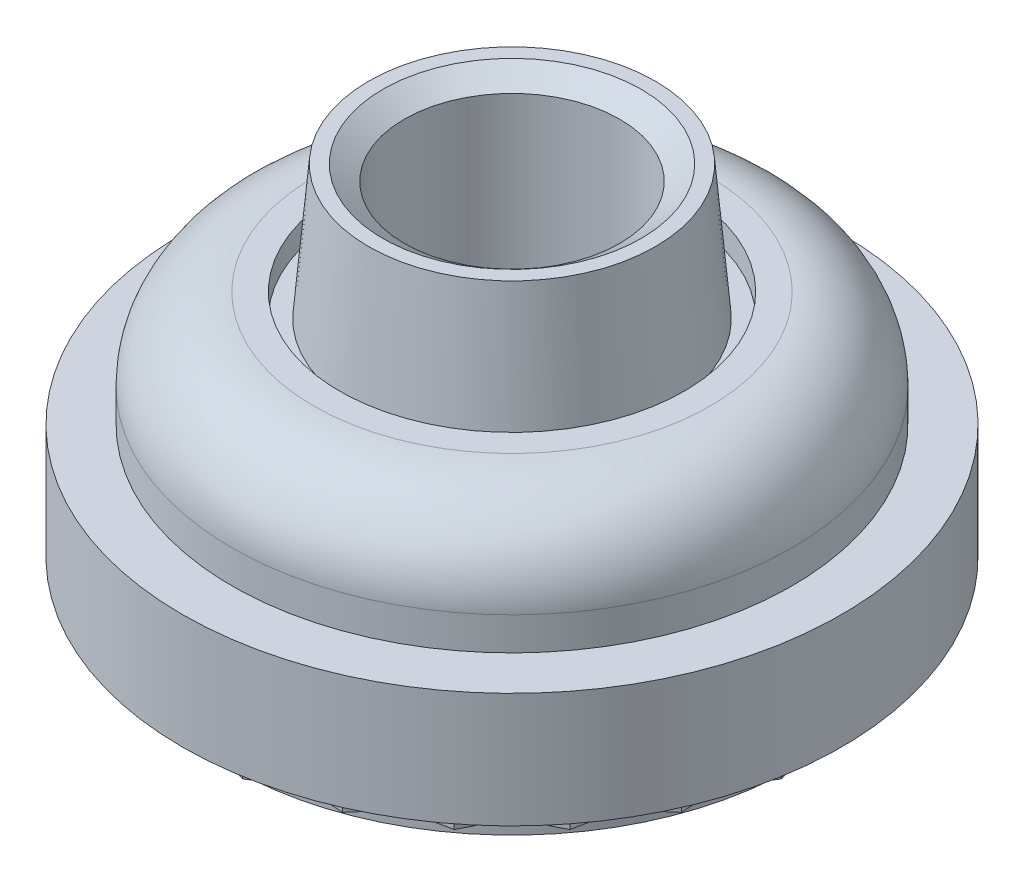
from build123d import *

# Parameters (mm, degrees)
CLINCHINGRINGSEGMENT_DEPTH = 0.388
CLINCHINGRING_COUNT        = 24
CLINCHINGRING_ANGLE        = 345
SQRCUT_DEPTH               = 0.97


with BuildPart() as part:
    # BodySke → Body (revolve)
    with BuildSketch(Plane.XY, mode=Mode.PRIVATE) as body_sk:
        with BuildLine():
            Line((6.315988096, 0), (7.65, 0))
            Line((7.65, 0), (7.65, 2.665))
            Line((7.65, 2.665), (6.5, 2.665))
            Line((6.5, 2.665), (6.5, 3.43))
            ThreePointArc((6.5, 3.43), (5.943502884, 4.773502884), (4.6, 5.33))
            Line((4.6, 5.33), (4, 5.33))
            Line((4, 5.33), (4, 4.787))
            Line((4, 4.787), (3.6, 4.787))
            Line((3.6, 4.787), (3.32764779, 7.9))
            Line((3.32764779, 7.9), (2.5, 7.9))
            Line((2.5, 7.9), (2.5, -0.97))
            Line((2.5, -0.97), (6.54, -0.97))
            Line((6.54, -0.97), (6.54, -0.776))
            Line((6.54, -0.776), (6.315988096, -0.388))
            Line((6.315988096, -0.388), (6.315988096, 0))
        make_face()
    revolve(body_sk.sketch.rotate(Axis((0, 0, 0), (0, 1, 0)), 90), axis=Axis((0, 0, 0), (0, 1, 0)))

    # EndChamferSke → EndChamfer (revolve, cut)
    with BuildSketch(Plane.XY, mode=Mode.PRIVATE) as endchamfer_sk:
        Polygon((3, -1.224), (3, -0.96746), (2.5, -0.617486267), (2.5, -1.224), align=None)
        Polygon((3, 7.9), (2.5, 7.550026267), (2.5, 7.9), align=None)
    revolve(endchamfer_sk.sketch.rotate(Axis((0, -2.54, 0), (0, 1, 0)), 90), axis=Axis((0, -2.54, 0), (0, 1, 0)), mode=Mode.SUBTRACT)

    # CliRinSegSke → ClinchingRingSegment (add)
    with BuildSketch(Plane.XZ):
        Polygon((0.948599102, 7.20532553), (0, 6.885), (-0.948599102, 7.20532553), (-0.920141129, 6.989165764), (0, 6.67845), (0.920141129, 6.989165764), align=None)
    clinchingringsegment = extrude(amount=CLINCHINGRINGSEGMENT_DEPTH)

    # ClinchingRing: ClinchingRingSegment ×24 about axis
    clinchingring_axis = Axis((0, 0, 0), (0, 1, 0))
    for i in range(1, CLINCHINGRING_COUNT):
        add(clinchingringsegment.rotate(clinchingring_axis, i * CLINCHINGRING_ANGLE / (CLINCHINGRING_COUNT - 1)))

    # SqrCutSke → SqrCut (cut)
    with BuildSketch(Plane.XZ.offset(0.97)):
        with BuildLine():
            Line((-3.346, -3.981), (3.346, -3.981))
            ThreePointArc((3.346, -3.981), (3.795012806, -3.795012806), (3.981, -3.346))
            Line((3.981, -3.346), (3.981, 3.346))
            ThreePointArc((3.981, 3.346), (3.795012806, 3.795012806), (3.346, 3.981))
            Line((3.346, 3.981), (-3.346, 3.981))
            ThreePointArc((-3.346, 3.981), (-3.795012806, 3.795012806), (-3.981, 3.346))
            Line((-3.981, 3.346), (-3.981, -3.346))
            ThreePointArc((-3.981, -3.346), (-3.795012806, -3.795012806), (-3.346, -3.981))
        make_face()
        with BuildLine():
            Line((3.6, -3.346), (3.6, 3.346))
            ThreePointArc((3.6, 3.346), (3.525605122, 3.525605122), (3.346, 3.6))
            Line((3.346, 3.6), (-3.346, 3.6))
            ThreePointArc((-3.346, 3.6), (-3.525605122, 3.525605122), (-3.6, 3.346))
            Line((-3.6, 3.346), (-3.6, -3.346))
            ThreePointArc((-3.6, -3.346), (-3.525605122, -3.525605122), (-3.346, -3.6))
            Line((-3.346, -3.6), (3.346, -3.6))
            ThreePointArc((3.346, -3.6), (3.525605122, -3.525605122), (3.6, -3.346))
        make_face(mode=Mode.SUBTRACT)
    extrude(amount=-SQRCUT_DEPTH, mode=Mode.SUBTRACT)


solid = part.part
